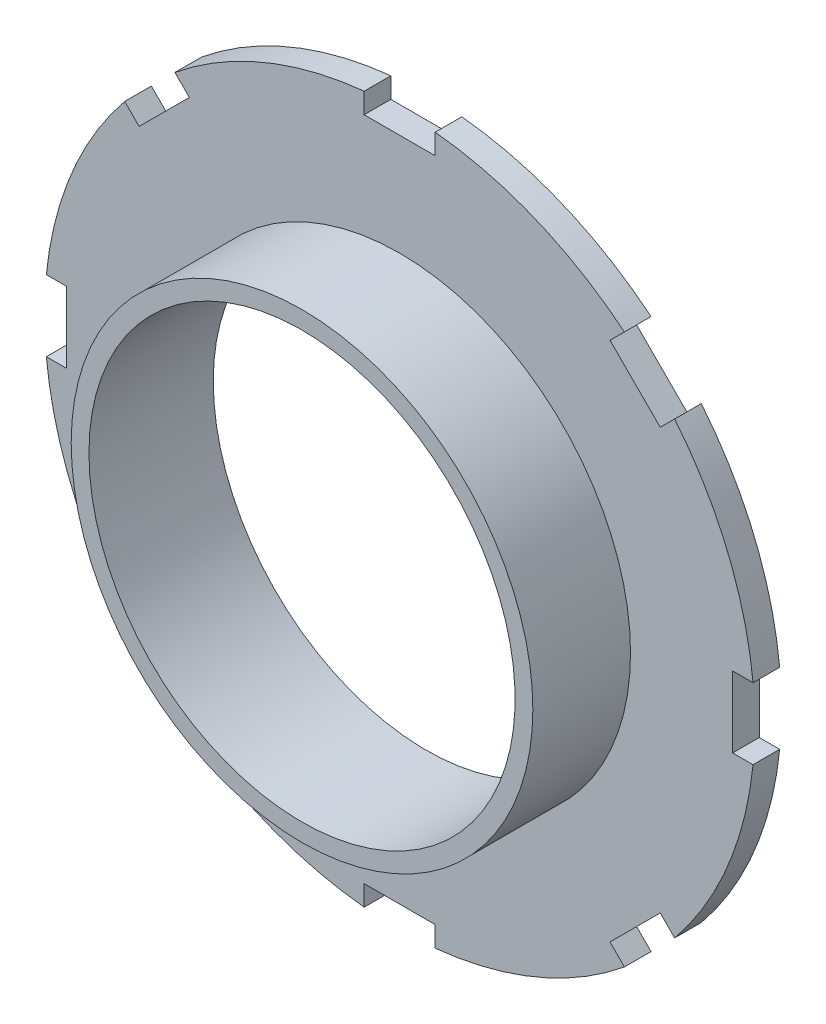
from build123d import *

# Parameters (mm, degrees)
ESQUISSE1_R                  = 40
EXTRUSION1_DEPTH             = 3
ESQUISSE2_R                  = 26
EXTRUSION2_DEPTH             = 11
ESQUISSE3_R                  = 24
ENL_V_MAT_EXTRU_1_DEPTH      = 59.275209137
ENL_V_MAT_EXTRU_2_DEPTH      = 59.275209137
R_P_TITION_CIRCULAIRE1_COUNT = 8


with BuildPart() as part:
    # Esquisse1 → Extrusion1 (new body)
    with BuildSketch(Plane.XY):
        Circle(ESQUISSE1_R)
    extrude(amount=EXTRUSION1_DEPTH)

    # Esquisse2 → Extrusion2 (add)
    with BuildSketch(Plane.XY.offset(3)):
        Circle(ESQUISSE2_R)
    extrude(amount=EXTRUSION2_DEPTH)

    # Esquisse3 → Enl_v. mat.-Extru.1 (cut, through all)
    with BuildSketch(Plane(origin=(0, 0, 0), x_dir=(-1, 0, 0), z_dir=(0, 0, -1))):
        Circle(ESQUISSE3_R)
    extrude(amount=-ENL_V_MAT_EXTRU_1_DEPTH, mode=Mode.SUBTRACT)

    # Esquisse4 → Enl_v. mat.-Extru.2 (cut, symmetric)
    with BuildSketch(Plane(origin=(0, 0, 0), x_dir=(-1, 0, 0), z_dir=(0, 0, -1))):
        Polygon((-4, 232.051628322), (-4, 39.799497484), (-4, 37.5), (4, 37.5), (4, 39.799497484), (4, 232.051628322), (4, 616.555889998), (-4, 616.555889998), align=None)
    enl_v_mat_extru_2 = extrude(amount=ENL_V_MAT_EXTRU_2_DEPTH, both=True, mode=Mode.SUBTRACT)

    # R_p_tition circulaire1: Enl_v. mat.-Extru.2 ×8 about axis
    r_p_tition_circulaire1_axis = Axis((0, 0, 0), (0, 0, -1))
    for i in range(1, R_P_TITION_CIRCULAIRE1_COUNT):
        add(enl_v_mat_extru_2.rotate(r_p_tition_circulaire1_axis, i * 360 / R_P_TITION_CIRCULAIRE1_COUNT), mode=Mode.SUBTRACT)


solid = part.part
